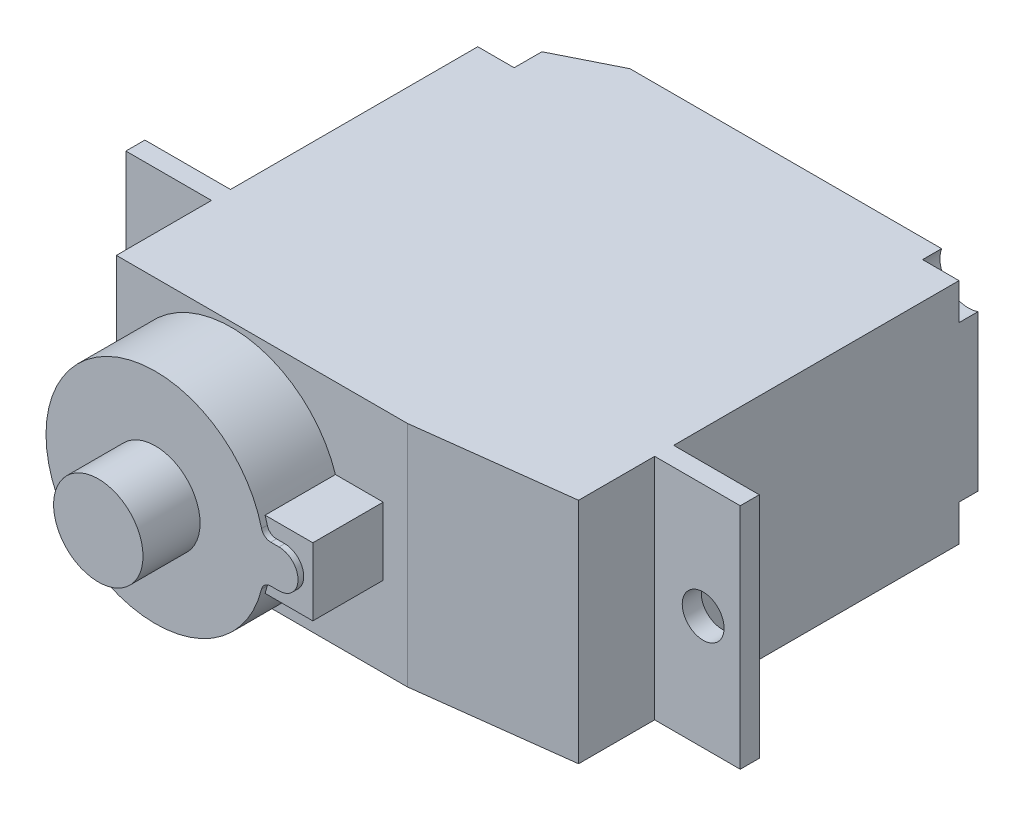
from build123d import *

# Parameters (mm, degrees)
SKETCH1_W           = 23.3
SKETCH1_H           = 12
BOSS_EXTRUDE1_DEPTH = 6
SKETCH2_W           = 1
SKETCH2_H           = 12
BOSS_EXTRUDE2_DEPTH = 4.5
SKETCH3_W           = 1
SKETCH3_H           = 12
BOSS_EXTRUDE3_DEPTH = 4.5
SKETCH4_R           = 1.1
CUT_EXTRUDE1_DEPTH  = 4
CUT_EXTRUDE2_DEPTH  = 16
BOSS_EXTRUDE4_DEPTH = 4
SKETCH7_W           = 2.712282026
SKETCH7_H           = 3.557780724
BOSS_EXTRUDE5_DEPTH = 3.7
SKETCH9_W           = 23.3
SKETCH9_H           = 12
BOSS_EXTRUDE6_DEPTH = 16
SKETCH10_R          = 1.5
CUT_EXTRUDE4_DEPTH  = 1
SKETCH11_R          = 1.5
CUT_EXTRUDE5_DEPTH  = 3
CUT_EXTRUDE6_DEPTH  = 13
SKETCH13_W          = 2
SKETCH13_H          = 3
CUT_EXTRUDE7_DEPTH  = 3
SKETCH14_R          = 2.35
BOSS_EXTRUDE7_DEPTH = 3


with BuildPart() as part:
    # Sketch1 → Boss-Extrude1 (new body)
    with BuildSketch(Plane.XY):
        Rectangle(SKETCH1_W, SKETCH1_H)
    extrude(amount=BOSS_EXTRUDE1_DEPTH)

    # Sketch2 → Boss-Extrude2 (add)
    with BuildSketch(Plane(origin=(11.65, 0, 0), x_dir=(0, 0, -1), z_dir=(1, 0, 0))):
        with Locations((-0.5, 0)):
            Rectangle(SKETCH2_W, SKETCH2_H)
    extrude(amount=BOSS_EXTRUDE2_DEPTH)

    # Sketch3 → Boss-Extrude3 (add)
    with BuildSketch(Plane.ZY.offset(11.65)):
        with Locations((0.5, 0)):
            Rectangle(SKETCH3_W, SKETCH3_H)
    extrude(amount=BOSS_EXTRUDE3_DEPTH)

    # Sketch4 → Cut-Extrude1 (cut)
    with BuildSketch(Plane(origin=(0, 0, 0), x_dir=(-1, 0, 0), z_dir=(0, 0, -1))):
        with Locations((-14.2, 0)):
            Circle(SKETCH4_R)
        with Locations((14.2, 0)):
            Circle(SKETCH4_R)
    extrude(amount=-CUT_EXTRUDE1_DEPTH, mode=Mode.SUBTRACT)

    # Sketch5 → Cut-Extrude2 (cut)
    with BuildSketch(Plane.XZ.offset(6)):
        Polygon((3.65, 6), (11.65, 5), (11.65, 6), align=None)
    extrude(amount=-CUT_EXTRUDE2_DEPTH, mode=Mode.SUBTRACT)

    # Sketch6 → Boss-Extrude4 (add)
    with BuildSketch(Plane.XY.offset(6)):
        with BuildLine():
            Line((0.9, 1), (0.46733055, 1))
            ThreePointArc((0.46733055, 1), (0.15910985, 1.106299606), (-0.018055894, 1.38))
            ThreePointArc((-0.018055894, 1.38), (-11.35, 0), (-0.018055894, -1.38))
            ThreePointArc((-0.018055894, -1.38), (0.15910985, -1.106299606), (0.46733055, -1))
            Line((0.46733055, -1), (0.9, -1))
            ThreePointArc((0.9, -1), (1.9, 0), (0.9, 1))
        make_face()
    extrude(amount=BOSS_EXTRUDE4_DEPTH)

    # Sketch7 → Boss-Extrude5 (add)
    with BuildSketch(Plane.XY.offset(6)):
        with Locations((1.022798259, 0)):
            Rectangle(SKETCH7_W, SKETCH7_H)
    extrude(amount=BOSS_EXTRUDE5_DEPTH)

    # Sketch9 → Boss-Extrude6 (add)
    with BuildSketch(Plane(origin=(0, 0, 0), x_dir=(-1, 0, 0), z_dir=(0, 0, -1))):
        Rectangle(SKETCH9_W, SKETCH9_H)
    extrude(amount=BOSS_EXTRUDE6_DEPTH)

    # Sketch10 → Cut-Extrude4 (cut)
    with BuildSketch(Plane(origin=(0, 0, -16), x_dir=(-1, 0, 0), z_dir=(0, 0, -1))):
        with Locations((-11.15, 5.5)):
            Circle(SKETCH10_R)
        with Locations((-11.15, -5.5)):
            Circle(SKETCH10_R)
    extrude(amount=-CUT_EXTRUDE4_DEPTH, mode=Mode.SUBTRACT)

    # Sketch11 → Cut-Extrude5 (cut)
    with BuildSketch(Plane(origin=(0, 0, -16), x_dir=(-1, 0, 0), z_dir=(0, 0, -1))):
        with Locations((11.15, 5.5)):
            Circle(SKETCH11_R)
        with Locations((11.15, -5.5)):
            Circle(SKETCH11_R)
    extrude(amount=-CUT_EXTRUDE5_DEPTH, mode=Mode.SUBTRACT)

    # Sketch12 → Cut-Extrude6 (cut)
    with BuildSketch(Plane.XZ.offset(6)):
        Polygon((-11.65, -13.5), (-6.65, -16), (-9.735786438, -16), (-11.65, -16), align=None)
    extrude(amount=-CUT_EXTRUDE6_DEPTH, mode=Mode.SUBTRACT)

    # Sketch13 → Cut-Extrude7 (cut)
    with BuildSketch(Plane(origin=(0, 0, -16), x_dir=(-1, 0, 0), z_dir=(0, 0, -1))):
        with Locations((10.65, 0)):
            Rectangle(SKETCH13_W, SKETCH13_H)
    extrude(amount=-CUT_EXTRUDE7_DEPTH, mode=Mode.SUBTRACT)

    # Sketch14 → Boss-Extrude7 (add)
    with BuildSketch(Plane.XY.offset(10)):
        with Locations((-5.6, 0)):
            Circle(SKETCH14_R)
    extrude(amount=BOSS_EXTRUDE7_DEPTH)


solid = part.part
